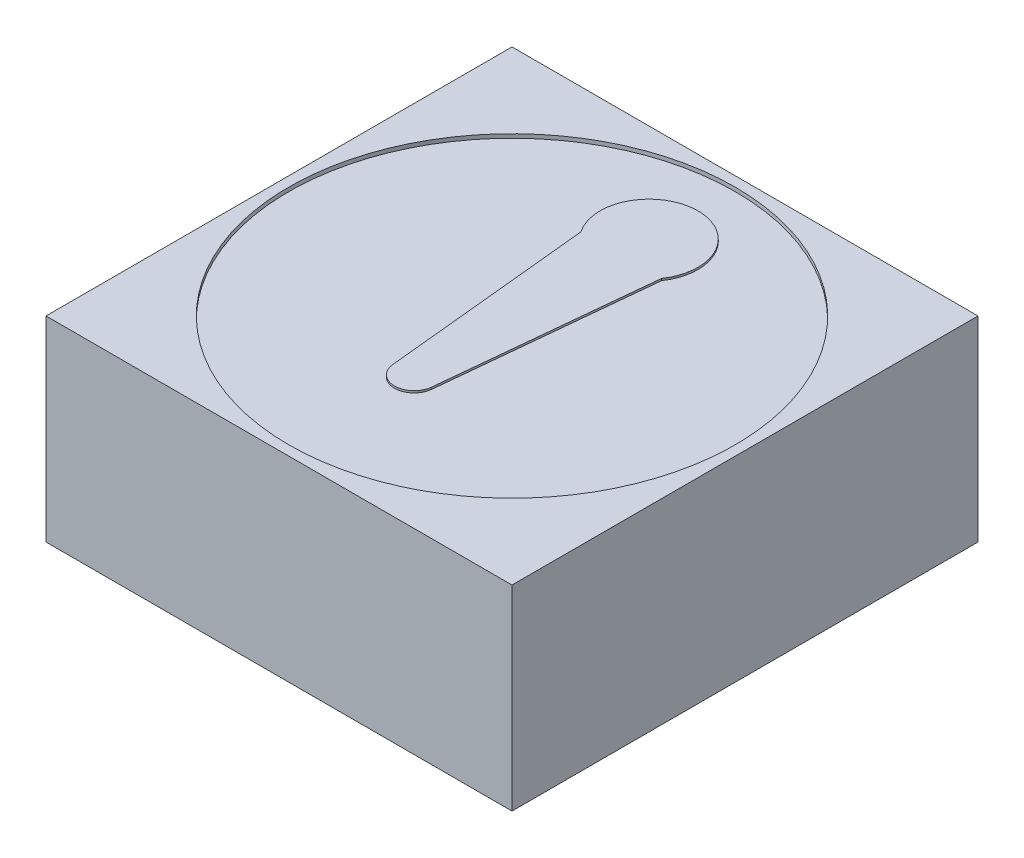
ISO-10303-21;
HEADER;
FILE_DESCRIPTION(('STEP AP214'),'2;1');
FILE_NAME('part.step','',(''),(''),'','','');
FILE_SCHEMA(('AUTOMOTIVE_DESIGN { 1 0 10303 214 1 1 1 1 }'));
ENDSEC;
DATA;
#1=APPLICATION_CONTEXT('core data for automotive mechanical design processes');
#2=APPLICATION_PROTOCOL_DEFINITION('international standard','automotive_design',2000,#1);
#3=PRODUCT_CONTEXT('',#1,'mechanical');
#4=PRODUCT('Part','Part','',(#3));
#5=PRODUCT_RELATED_PRODUCT_CATEGORY('part','',(#4));
#6=PRODUCT_DEFINITION_FORMATION('','',#4);
#7=PRODUCT_DEFINITION_CONTEXT('part definition',#1,'design');
#8=PRODUCT_DEFINITION('design','',#6,#7);
#9=PRODUCT_DEFINITION_SHAPE('','',#8);
#10=(LENGTH_UNIT() NAMED_UNIT(*) SI_UNIT(.MILLI.,.METRE.));
#11=(NAMED_UNIT(*) PLANE_ANGLE_UNIT() SI_UNIT($,.RADIAN.));
#12=(NAMED_UNIT(*) SI_UNIT($,.STERADIAN.) SOLID_ANGLE_UNIT());
#13=UNCERTAINTY_MEASURE_WITH_UNIT(LENGTH_MEASURE(1.E-05),#10,'distance_accuracy_value','');
#14=(GEOMETRIC_REPRESENTATION_CONTEXT(3) GLOBAL_UNCERTAINTY_ASSIGNED_CONTEXT((#13)) GLOBAL_UNIT_ASSIGNED_CONTEXT((#10,
#11,#12)) REPRESENTATION_CONTEXT('',''));
#15=CARTESIAN_POINT('',(0.,0.,0.));
#16=DIRECTION('',(0.,0.,1.));
#17=DIRECTION('',(1.,0.,0.));
#18=AXIS2_PLACEMENT_3D('',#15,#16,#17);
#19=CARTESIAN_POINT('',(0.,0.98,0.));
#20=DIRECTION('',(0.,1.,0.));
#21=DIRECTION('',(0.,0.,1.));
#22=AXIS2_PLACEMENT_3D('',#19,#20,#21);
#23=PLANE('',#22);
#24=CARTESIAN_POINT('',(0.,0.98,0.));
#25=DIRECTION('',(0.,1.,0.));
#26=DIRECTION('',(0.,0.,1.));
#27=AXIS2_PLACEMENT_3D('',#24,#25,#26);
#28=CIRCLE('',#27,1.14);
#29=CARTESIAN_POINT('',(0.,0.98,1.14));
#30=VERTEX_POINT('',#29);
#31=EDGE_CURVE('E133',#30,#30,#28,.T.);
#32=ORIENTED_EDGE('',*,*,#31,.T.);
#33=EDGE_LOOP('',(#32));
#34=FACE_BOUND('',#33,.T.);
#35=DIRECTION('',(0.0992060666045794,0.,-0.995066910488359));
#36=VECTOR('',#35,1.);
#37=CARTESIAN_POINT('',(0.0995066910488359,0.98,0.509920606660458));
#38=LINE('',#37,#36);
#39=CARTESIAN_POINT('',(0.0995066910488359,0.98,0.509920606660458));
#40=VERTEX_POINT('',#39);
#41=CARTESIAN_POINT('',(0.20601317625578,0.98,-0.558371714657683));
#42=VERTEX_POINT('',#41);
#43=EDGE_CURVE('E293',#40,#42,#38,.T.);
#44=ORIENTED_EDGE('',*,*,#43,.F.);
#45=CARTESIAN_POINT('',(0.,0.98,0.5));
#46=DIRECTION('',(0.,1.,0.));
#47=DIRECTION('',(0.,0.,1.));
#48=AXIS2_PLACEMENT_3D('',#45,#46,#47);
#49=CIRCLE('',#48,0.1);
#50=CARTESIAN_POINT('',(-0.0995066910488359,0.98,0.509920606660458));
#51=VERTEX_POINT('',#50);
#52=EDGE_CURVE('E131',#51,#40,#49,.T.);
#53=ORIENTED_EDGE('',*,*,#52,.F.);
#54=DIRECTION('',(0.0992060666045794,0.,0.995066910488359));
#55=VECTOR('',#54,1.);
#56=CARTESIAN_POINT('',(-0.0995066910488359,0.98,0.509920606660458));
#57=LINE('',#56,#55);
#58=CARTESIAN_POINT('',(-0.20601317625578,0.98,-0.558371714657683));
#59=VERTEX_POINT('',#58);
#60=EDGE_CURVE('E127',#59,#51,#57,.T.);
#61=ORIENTED_EDGE('',*,*,#60,.F.);
#62=CARTESIAN_POINT('',(0.,0.98,-0.7));
#63=DIRECTION('',(0.,1.,0.));
#64=DIRECTION('',(0.,0.,1.));
#65=AXIS2_PLACEMENT_3D('',#62,#63,#64);
#66=CIRCLE('',#65,0.25);
#67=EDGE_CURVE('E290',#42,#59,#66,.T.);
#68=ORIENTED_EDGE('',*,*,#67,.F.);
#69=EDGE_LOOP('',(#44,#53,#61,#68));
#70=FACE_BOUND('',#69,.T.);
#71=ADVANCED_FACE('F34',(#34,#70),#23,.T.);
#72=CARTESIAN_POINT('',(1.19,1.,1.19));
#73=DIRECTION('',(-1.,0.,0.));
#74=DIRECTION('',(0.,0.,1.));
#75=AXIS2_PLACEMENT_3D('',#72,#73,#74);
#76=PLANE('',#75);
#77=DIRECTION('',(0.,0.,-1.));
#78=VECTOR('',#77,1.);
#79=CARTESIAN_POINT('',(1.19,0.,1.19));
#80=LINE('',#79,#78);
#81=CARTESIAN_POINT('',(1.19,0.,1.19));
#82=VERTEX_POINT('',#81);
#83=CARTESIAN_POINT('',(1.19,0.,-1.19));
#84=VERTEX_POINT('',#83);
#85=EDGE_CURVE('E143',#82,#84,#80,.T.);
#86=ORIENTED_EDGE('',*,*,#85,.T.);
#87=DIRECTION('',(0.,-1.,0.));
#88=VECTOR('',#87,1.);
#89=CARTESIAN_POINT('',(1.19,1.,-1.19));
#90=LINE('',#89,#88);
#91=CARTESIAN_POINT('',(1.19,1.,-1.19));
#92=VERTEX_POINT('',#91);
#93=EDGE_CURVE('E11',#92,#84,#90,.T.);
#94=ORIENTED_EDGE('',*,*,#93,.F.);
#95=DIRECTION('',(0.,0.,-1.));
#96=VECTOR('',#95,1.);
#97=CARTESIAN_POINT('',(1.19,1.,1.19));
#98=LINE('',#97,#96);
#99=CARTESIAN_POINT('',(1.19,1.,1.19));
#100=VERTEX_POINT('',#99);
#101=EDGE_CURVE('E144',#100,#92,#98,.T.);
#102=ORIENTED_EDGE('',*,*,#101,.F.);
#103=DIRECTION('',(0.,-1.,0.));
#104=VECTOR('',#103,1.);
#105=CARTESIAN_POINT('',(1.19,1.,1.19));
#106=LINE('',#105,#104);
#107=EDGE_CURVE('E150',#100,#82,#106,.T.);
#108=ORIENTED_EDGE('',*,*,#107,.T.);
#109=EDGE_LOOP('',(#86,#94,#102,#108));
#110=FACE_BOUND('',#109,.T.);
#111=ADVANCED_FACE('F36',(#110),#76,.F.);
#112=CARTESIAN_POINT('',(-1.19,1.,-1.19));
#113=DIRECTION('',(0.,0.,1.));
#114=DIRECTION('',(1.,0.,0.));
#115=AXIS2_PLACEMENT_3D('',#112,#113,#114);
#116=PLANE('',#115);
#117=DIRECTION('',(-1.,0.,0.));
#118=VECTOR('',#117,1.);
#119=CARTESIAN_POINT('',(-1.19,0.,-1.19));
#120=LINE('',#119,#118);
#121=CARTESIAN_POINT('',(-1.19,0.,-1.19));
#122=VERTEX_POINT('',#121);
#123=EDGE_CURVE('E153',#84,#122,#120,.T.);
#124=ORIENTED_EDGE('',*,*,#123,.T.);
#125=DIRECTION('',(0.,-1.,0.));
#126=VECTOR('',#125,1.);
#127=CARTESIAN_POINT('',(-1.19,1.,-1.19));
#128=LINE('',#127,#126);
#129=CARTESIAN_POINT('',(-1.19,1.,-1.19));
#130=VERTEX_POINT('',#129);
#131=EDGE_CURVE('E42',#130,#122,#128,.T.);
#132=ORIENTED_EDGE('',*,*,#131,.F.);
#133=DIRECTION('',(-1.,0.,0.));
#134=VECTOR('',#133,1.);
#135=CARTESIAN_POINT('',(-1.19,1.,-1.19));
#136=LINE('',#135,#134);
#137=EDGE_CURVE('E86',#92,#130,#136,.T.);
#138=ORIENTED_EDGE('',*,*,#137,.F.);
#139=ORIENTED_EDGE('',*,*,#93,.T.);
#140=EDGE_LOOP('',(#124,#132,#138,#139));
#141=FACE_BOUND('',#140,.T.);
#142=ADVANCED_FACE('F182',(#141),#116,.F.);
#143=CARTESIAN_POINT('',(-1.19,1.,1.19));
#144=DIRECTION('',(1.,0.,0.));
#145=DIRECTION('',(0.,0.,-1.));
#146=AXIS2_PLACEMENT_3D('',#143,#144,#145);
#147=PLANE('',#146);
#148=DIRECTION('',(0.,0.,1.));
#149=VECTOR('',#148,1.);
#150=CARTESIAN_POINT('',(-1.19,0.,1.19));
#151=LINE('',#150,#149);
#152=CARTESIAN_POINT('',(-1.19,0.,1.19));
#153=VERTEX_POINT('',#152);
#154=EDGE_CURVE('E155',#122,#153,#151,.T.);
#155=ORIENTED_EDGE('',*,*,#154,.T.);
#156=DIRECTION('',(0.,-1.,0.));
#157=VECTOR('',#156,1.);
#158=CARTESIAN_POINT('',(-1.19,1.,1.19));
#159=LINE('',#158,#157);
#160=CARTESIAN_POINT('',(-1.19,1.,1.19));
#161=VERTEX_POINT('',#160);
#162=EDGE_CURVE('E159',#161,#153,#159,.T.);
#163=ORIENTED_EDGE('',*,*,#162,.F.);
#164=DIRECTION('',(0.,0.,1.));
#165=VECTOR('',#164,1.);
#166=CARTESIAN_POINT('',(-1.19,1.,1.19));
#167=LINE('',#166,#165);
#168=EDGE_CURVE('E147',#130,#161,#167,.T.);
#169=ORIENTED_EDGE('',*,*,#168,.F.);
#170=ORIENTED_EDGE('',*,*,#131,.T.);
#171=EDGE_LOOP('',(#155,#163,#169,#170));
#172=FACE_BOUND('',#171,.T.);
#173=ADVANCED_FACE('F164',(#172),#147,.F.);
#174=CARTESIAN_POINT('',(-1.19,1.,1.19));
#175=DIRECTION('',(0.,0.,-1.));
#176=DIRECTION('',(-1.,0.,0.));
#177=AXIS2_PLACEMENT_3D('',#174,#175,#176);
#178=PLANE('',#177);
#179=DIRECTION('',(1.,0.,0.));
#180=VECTOR('',#179,1.);
#181=CARTESIAN_POINT('',(-1.19,0.,1.19));
#182=LINE('',#181,#180);
#183=EDGE_CURVE('E79',#153,#82,#182,.T.);
#184=ORIENTED_EDGE('',*,*,#183,.T.);
#185=ORIENTED_EDGE('',*,*,#107,.F.);
#186=DIRECTION('',(1.,0.,0.));
#187=VECTOR('',#186,1.);
#188=CARTESIAN_POINT('',(-1.19,1.,1.19));
#189=LINE('',#188,#187);
#190=EDGE_CURVE('E58',#161,#100,#189,.T.);
#191=ORIENTED_EDGE('',*,*,#190,.F.);
#192=ORIENTED_EDGE('',*,*,#162,.T.);
#193=EDGE_LOOP('',(#184,#185,#191,#192));
#194=FACE_BOUND('',#193,.T.);
#195=ADVANCED_FACE('F172',(#194),#178,.F.);
#196=CARTESIAN_POINT('',(0.,1.,0.));
#197=DIRECTION('',(0.,-1.,0.));
#198=DIRECTION('',(0.,0.,-1.));
#199=AXIS2_PLACEMENT_3D('',#196,#197,#198);
#200=PLANE('',#199);
#201=CARTESIAN_POINT('',(0.,1.,0.));
#202=DIRECTION('',(0.,1.,0.));
#203=DIRECTION('',(0.,0.,1.));
#204=AXIS2_PLACEMENT_3D('',#201,#202,#203);
#205=CIRCLE('',#204,1.14);
#206=CARTESIAN_POINT('',(0.,1.,1.14));
#207=VERTEX_POINT('',#206);
#208=EDGE_CURVE('E136',#207,#207,#205,.T.);
#209=ORIENTED_EDGE('',*,*,#208,.F.);
#210=EDGE_LOOP('',(#209));
#211=FACE_BOUND('',#210,.T.);
#212=ORIENTED_EDGE('',*,*,#101,.T.);
#213=ORIENTED_EDGE('',*,*,#137,.T.);
#214=ORIENTED_EDGE('',*,*,#168,.T.);
#215=ORIENTED_EDGE('',*,*,#190,.T.);
#216=EDGE_LOOP('',(#212,#213,#214,#215));
#217=FACE_BOUND('',#216,.T.);
#218=ADVANCED_FACE('F174',(#211,#217),#200,.F.);
#219=CARTESIAN_POINT('',(0.,0.,0.));
#220=DIRECTION('',(0.,-1.,0.));
#221=DIRECTION('',(0.,0.,-1.));
#222=AXIS2_PLACEMENT_3D('',#219,#220,#221);
#223=PLANE('',#222);
#224=ORIENTED_EDGE('',*,*,#85,.F.);
#225=ORIENTED_EDGE('',*,*,#183,.F.);
#226=ORIENTED_EDGE('',*,*,#154,.F.);
#227=ORIENTED_EDGE('',*,*,#123,.F.);
#228=EDGE_LOOP('',(#224,#225,#226,#227));
#229=FACE_BOUND('',#228,.T.);
#230=ADVANCED_FACE('F168',(#229),#223,.T.);
#231=CARTESIAN_POINT('',(0.,0.8,0.));
#232=DIRECTION('',(0.,1.,0.));
#233=DIRECTION('',(0.,0.,1.));
#234=AXIS2_PLACEMENT_3D('',#231,#232,#233);
#235=CYLINDRICAL_SURFACE('',#234,1.14);
#236=ORIENTED_EDGE('',*,*,#31,.F.);
#237=EDGE_LOOP('',(#236));
#238=FACE_BOUND('',#237,.T.);
#239=ORIENTED_EDGE('',*,*,#208,.T.);
#240=EDGE_LOOP('',(#239));
#241=FACE_BOUND('',#240,.T.);
#242=ADVANCED_FACE('F195',(#238,#241),#235,.F.);
#243=CARTESIAN_POINT('',(0.,0.99,0.5));
#244=DIRECTION('',(0.,-1.,0.));
#245=DIRECTION('',(0.,0.,-1.));
#246=AXIS2_PLACEMENT_3D('',#243,#244,#245);
#247=CYLINDRICAL_SURFACE('',#246,0.1);
#248=ORIENTED_EDGE('',*,*,#52,.T.);
#249=DIRECTION('',(0.,-1.,0.));
#250=VECTOR('',#249,1.);
#251=CARTESIAN_POINT('',(0.0995066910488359,0.99,0.509920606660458));
#252=LINE('',#251,#250);
#253=CARTESIAN_POINT('',(0.0995066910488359,0.99,0.509920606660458));
#254=VERTEX_POINT('',#253);
#255=EDGE_CURVE('E112',#254,#40,#252,.T.);
#256=ORIENTED_EDGE('',*,*,#255,.F.);
#257=CARTESIAN_POINT('',(0.,0.99,0.5));
#258=DIRECTION('',(0.,1.,0.));
#259=DIRECTION('',(0.,0.,1.));
#260=AXIS2_PLACEMENT_3D('',#257,#258,#259);
#261=CIRCLE('',#260,0.1);
#262=CARTESIAN_POINT('',(-0.0995066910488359,0.99,0.509920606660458));
#263=VERTEX_POINT('',#262);
#264=EDGE_CURVE('E119',#263,#254,#261,.T.);
#265=ORIENTED_EDGE('',*,*,#264,.F.);
#266=DIRECTION('',(0.,-1.,0.));
#267=VECTOR('',#266,1.);
#268=CARTESIAN_POINT('',(-0.0995066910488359,0.99,0.509920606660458));
#269=LINE('',#268,#267);
#270=EDGE_CURVE('E288',#263,#51,#269,.T.);
#271=ORIENTED_EDGE('',*,*,#270,.T.);
#272=EDGE_LOOP('',(#248,#256,#265,#271));
#273=FACE_BOUND('',#272,.T.);
#274=ADVANCED_FACE('F129',(#273),#247,.T.);
#275=CARTESIAN_POINT('',(0.0995066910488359,0.99,0.509920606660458));
#276=DIRECTION('',(-0.995066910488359,0.,-0.0992060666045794));
#277=DIRECTION('',(-0.0992060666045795,0.,0.995066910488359));
#278=AXIS2_PLACEMENT_3D('',#275,#276,#277);
#279=PLANE('',#278);
#280=ORIENTED_EDGE('',*,*,#43,.T.);
#281=DIRECTION('',(0.,-1.,0.));
#282=VECTOR('',#281,1.);
#283=CARTESIAN_POINT('',(0.20601317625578,0.99,-0.558371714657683));
#284=LINE('',#283,#282);
#285=CARTESIAN_POINT('',(0.20601317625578,0.99,-0.558371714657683));
#286=VERTEX_POINT('',#285);
#287=EDGE_CURVE('E115',#286,#42,#284,.T.);
#288=ORIENTED_EDGE('',*,*,#287,.F.);
#289=DIRECTION('',(0.0992060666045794,0.,-0.995066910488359));
#290=VECTOR('',#289,1.);
#291=CARTESIAN_POINT('',(0.0995066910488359,0.99,0.509920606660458));
#292=LINE('',#291,#290);
#293=EDGE_CURVE('E108',#254,#286,#292,.T.);
#294=ORIENTED_EDGE('',*,*,#293,.F.);
#295=ORIENTED_EDGE('',*,*,#255,.T.);
#296=EDGE_LOOP('',(#280,#288,#294,#295));
#297=FACE_BOUND('',#296,.T.);
#298=ADVANCED_FACE('F110',(#297),#279,.F.);
#299=CARTESIAN_POINT('',(0.,0.99,-0.7));
#300=DIRECTION('',(0.,-1.,0.));
#301=DIRECTION('',(0.,0.,-1.));
#302=AXIS2_PLACEMENT_3D('',#299,#300,#301);
#303=CYLINDRICAL_SURFACE('',#302,0.25);
#304=ORIENTED_EDGE('',*,*,#67,.T.);
#305=DIRECTION('',(0.,-1.,0.));
#306=VECTOR('',#305,1.);
#307=CARTESIAN_POINT('',(-0.20601317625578,0.99,-0.558371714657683));
#308=LINE('',#307,#306);
#309=CARTESIAN_POINT('',(-0.20601317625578,0.99,-0.558371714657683));
#310=VERTEX_POINT('',#309);
#311=EDGE_CURVE('E49',#310,#59,#308,.T.);
#312=ORIENTED_EDGE('',*,*,#311,.F.);
#313=CARTESIAN_POINT('',(0.,0.99,-0.7));
#314=DIRECTION('',(0.,1.,0.));
#315=DIRECTION('',(0.,0.,1.));
#316=AXIS2_PLACEMENT_3D('',#313,#314,#315);
#317=CIRCLE('',#316,0.25);
#318=EDGE_CURVE('E118',#286,#310,#317,.T.);
#319=ORIENTED_EDGE('',*,*,#318,.F.);
#320=ORIENTED_EDGE('',*,*,#287,.T.);
#321=EDGE_LOOP('',(#304,#312,#319,#320));
#322=FACE_BOUND('',#321,.T.);
#323=ADVANCED_FACE('F218',(#322),#303,.T.);
#324=CARTESIAN_POINT('',(-0.0995066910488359,0.99,0.509920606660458));
#325=DIRECTION('',(0.995066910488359,0.,-0.0992060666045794));
#326=DIRECTION('',(-0.0992060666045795,0.,-0.995066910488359));
#327=AXIS2_PLACEMENT_3D('',#324,#325,#326);
#328=PLANE('',#327);
#329=ORIENTED_EDGE('',*,*,#60,.T.);
#330=ORIENTED_EDGE('',*,*,#270,.F.);
#331=DIRECTION('',(0.0992060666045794,0.,0.995066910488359));
#332=VECTOR('',#331,1.);
#333=CARTESIAN_POINT('',(-0.0995066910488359,0.99,0.509920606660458));
#334=LINE('',#333,#332);
#335=EDGE_CURVE('E123',#310,#263,#334,.T.);
#336=ORIENTED_EDGE('',*,*,#335,.F.);
#337=ORIENTED_EDGE('',*,*,#311,.T.);
#338=EDGE_LOOP('',(#329,#330,#336,#337));
#339=FACE_BOUND('',#338,.T.);
#340=ADVANCED_FACE('F224',(#339),#328,.F.);
#341=CARTESIAN_POINT('',(0.,0.99,0.5));
#342=DIRECTION('',(0.,1.,0.));
#343=DIRECTION('',(0.,0.,1.));
#344=AXIS2_PLACEMENT_3D('',#341,#342,#343);
#345=PLANE('',#344);
#346=ORIENTED_EDGE('',*,*,#264,.T.);
#347=ORIENTED_EDGE('',*,*,#293,.T.);
#348=ORIENTED_EDGE('',*,*,#318,.T.);
#349=ORIENTED_EDGE('',*,*,#335,.T.);
#350=EDGE_LOOP('',(#346,#347,#348,#349));
#351=FACE_BOUND('',#350,.T.);
#352=ADVANCED_FACE('F122',(#351),#345,.T.);
#353=CLOSED_SHELL('',(#71,#111,#142,#173,#195,#218,#230,#242,#274,#298,#323,#340,#352));
#354=MANIFOLD_SOLID_BREP('B2',#353);
#355=ADVANCED_BREP_SHAPE_REPRESENTATION('',(#18,#354),#14);
#356=SHAPE_DEFINITION_REPRESENTATION(#9,#355);
ENDSEC;
END-ISO-10303-21;
